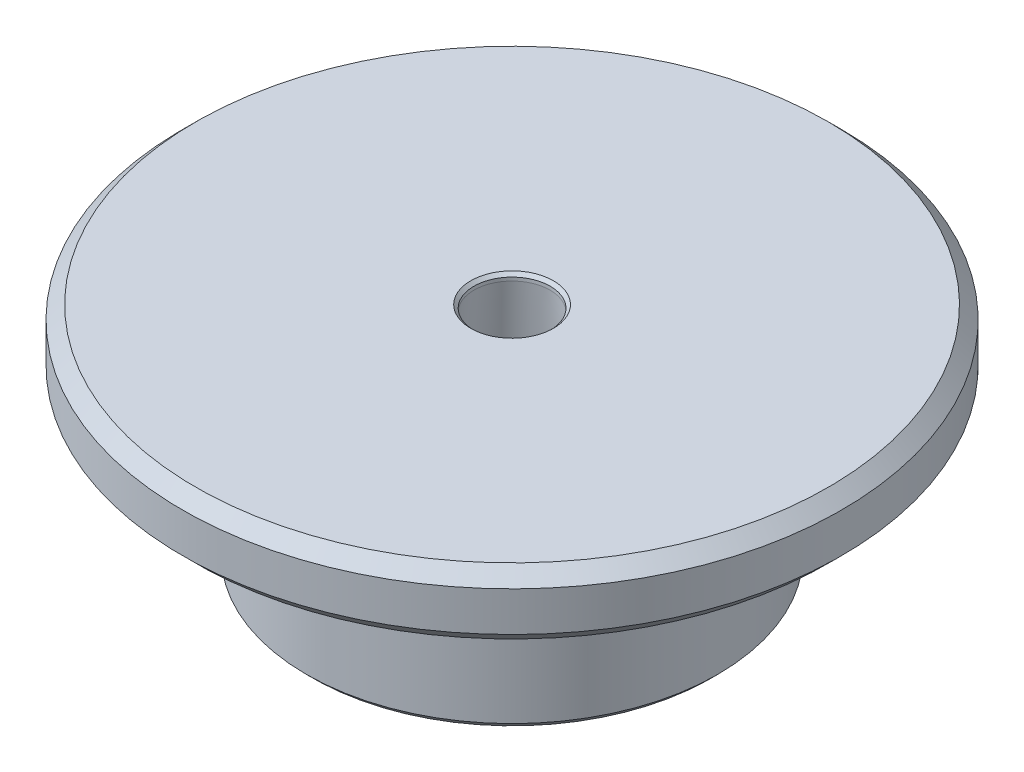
ISO-10303-21;
HEADER;
FILE_DESCRIPTION(('STEP AP214'),'2;1');
FILE_NAME('part.step','',(''),(''),'','','');
FILE_SCHEMA(('AUTOMOTIVE_DESIGN { 1 0 10303 214 1 1 1 1 }'));
ENDSEC;
DATA;
#1=APPLICATION_CONTEXT('core data for automotive mechanical design processes');
#2=APPLICATION_PROTOCOL_DEFINITION('international standard','automotive_design',2000,#1);
#3=PRODUCT_CONTEXT('',#1,'mechanical');
#4=PRODUCT('Part','Part','',(#3));
#5=PRODUCT_RELATED_PRODUCT_CATEGORY('part','',(#4));
#6=PRODUCT_DEFINITION_FORMATION('','',#4);
#7=PRODUCT_DEFINITION_CONTEXT('part definition',#1,'design');
#8=PRODUCT_DEFINITION('design','',#6,#7);
#9=PRODUCT_DEFINITION_SHAPE('','',#8);
#10=(LENGTH_UNIT() NAMED_UNIT(*) SI_UNIT(.MILLI.,.METRE.));
#11=(NAMED_UNIT(*) PLANE_ANGLE_UNIT() SI_UNIT($,.RADIAN.));
#12=(NAMED_UNIT(*) SI_UNIT($,.STERADIAN.) SOLID_ANGLE_UNIT());
#13=UNCERTAINTY_MEASURE_WITH_UNIT(LENGTH_MEASURE(1.E-05),#10,'distance_accuracy_value','');
#14=(GEOMETRIC_REPRESENTATION_CONTEXT(3) GLOBAL_UNCERTAINTY_ASSIGNED_CONTEXT((#13)) GLOBAL_UNIT_ASSIGNED_CONTEXT((#10,
#11,#12)) REPRESENTATION_CONTEXT('',''));
#15=CARTESIAN_POINT('',(0.,0.,0.));
#16=DIRECTION('',(0.,0.,1.));
#17=DIRECTION('',(1.,0.,0.));
#18=AXIS2_PLACEMENT_3D('',#15,#16,#17);
#19=CARTESIAN_POINT('',(0.,-14.4,0.));
#20=DIRECTION('',(0.,-1.,0.));
#21=DIRECTION('',(0.,0.,-1.));
#22=AXIS2_PLACEMENT_3D('',#19,#20,#21);
#23=TOROIDAL_SURFACE('',#22,12.5,0.399999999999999);
#24=CARTESIAN_POINT('',(0.,-14.0107965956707,0.));
#25=DIRECTION('',(0.,-1.,0.));
#26=DIRECTION('',(0.,0.,-1.));
#27=AXIS2_PLACEMENT_3D('',#24,#25,#26);
#28=CIRCLE('',#27,12.4076923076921);
#29=CARTESIAN_POINT('',(0.,-14.0107965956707,-12.4076923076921));
#30=VERTEX_POINT('',#29);
#31=EDGE_CURVE('E10',#30,#30,#28,.F.);
#32=ORIENTED_EDGE('',*,*,#31,.T.);
#33=EDGE_LOOP('',(#32));
#34=FACE_BOUND('',#33,.T.);
#35=CARTESIAN_POINT('',(0.,-14.5780184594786,0.));
#36=DIRECTION('',(0.,-1.,0.));
#37=DIRECTION('',(0.,0.,-1.));
#38=AXIS2_PLACEMENT_3D('',#35,#36,#37);
#39=CIRCLE('',#38,12.1417969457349);
#40=CARTESIAN_POINT('',(0.,-14.5780184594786,-12.1417969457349));
#41=VERTEX_POINT('',#40);
#42=EDGE_CURVE('E120',#41,#41,#39,.T.);
#43=ORIENTED_EDGE('',*,*,#42,.T.);
#44=EDGE_LOOP('',(#43));
#45=FACE_BOUND('',#44,.T.);
#46=ADVANCED_FACE('F34',(#34,#45),#23,.T.);
#47=CARTESIAN_POINT('',(0.,-15.5,0.));
#48=DIRECTION('',(0.,-1.,0.));
#49=DIRECTION('',(0.,0.,-1.));
#50=AXIS2_PLACEMENT_3D('',#47,#48,#49);
#51=CONICAL_SURFACE('',#50,12.6,0.461225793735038);
#52=ORIENTED_EDGE('',*,*,#42,.F.);
#53=EDGE_LOOP('',(#52));
#54=FACE_BOUND('',#53,.T.);
#55=CARTESIAN_POINT('',(0.,-15.5,0.));
#56=DIRECTION('',(0.,-1.,0.));
#57=DIRECTION('',(0.,0.,-1.));
#58=AXIS2_PLACEMENT_3D('',#55,#56,#57);
#59=CIRCLE('',#58,12.6);
#60=CARTESIAN_POINT('',(0.,-15.5,-12.6));
#61=VERTEX_POINT('',#60);
#62=EDGE_CURVE('E124',#61,#61,#59,.T.);
#63=ORIENTED_EDGE('',*,*,#62,.T.);
#64=EDGE_LOOP('',(#63));
#65=FACE_BOUND('',#64,.T.);
#66=ADVANCED_FACE('F130',(#54,#65),#51,.F.);
#67=CARTESIAN_POINT('',(0.,0.,0.));
#68=DIRECTION('',(0.,-1.,0.));
#69=DIRECTION('',(0.,0.,-1.));
#70=AXIS2_PLACEMENT_3D('',#67,#68,#69);
#71=CYLINDRICAL_SURFACE('',#70,2.89378967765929);
#72=CARTESIAN_POINT('',(0.,-0.240000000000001,0.));
#73=DIRECTION('',(0.,-1.,0.));
#74=DIRECTION('',(0.,0.,-1.));
#75=AXIS2_PLACEMENT_3D('',#72,#73,#74);
#76=CIRCLE('',#75,2.89378967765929);
#77=CARTESIAN_POINT('',(0.,-0.240000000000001,-2.89378967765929));
#78=VERTEX_POINT('',#77);
#79=EDGE_CURVE('E102',#78,#78,#76,.F.);
#80=ORIENTED_EDGE('',*,*,#79,.T.);
#81=EDGE_LOOP('',(#80));
#82=FACE_BOUND('',#81,.T.);
#83=CARTESIAN_POINT('',(0.,-0.5,0.));
#84=DIRECTION('',(0.,-1.,0.));
#85=DIRECTION('',(0.,0.,-1.));
#86=AXIS2_PLACEMENT_3D('',#83,#84,#85);
#87=CIRCLE('',#86,2.89378967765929);
#88=CARTESIAN_POINT('',(0.,-0.5,-2.89378967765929));
#89=VERTEX_POINT('',#88);
#90=EDGE_CURVE('E121',#89,#89,#87,.T.);
#91=ORIENTED_EDGE('',*,*,#90,.T.);
#92=EDGE_LOOP('',(#91));
#93=FACE_BOUND('',#92,.T.);
#94=ADVANCED_FACE('F146',(#82,#93),#71,.F.);
#95=CARTESIAN_POINT('',(2.89378967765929,0.,0.));
#96=DIRECTION('',(0.,-1.,0.));
#97=DIRECTION('',(0.,0.,-1.));
#98=AXIS2_PLACEMENT_3D('',#95,#96,#97);
#99=PLANE('',#98);
#100=CARTESIAN_POINT('',(0.,0.,0.));
#101=DIRECTION('',(0.,-1.,0.));
#102=DIRECTION('',(0.,0.,-1.));
#103=AXIS2_PLACEMENT_3D('',#100,#101,#102);
#104=CIRCLE('',#103,3.13378967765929);
#105=CARTESIAN_POINT('',(0.,0.,-3.13378967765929));
#106=VERTEX_POINT('',#105);
#107=EDGE_CURVE('E105',#106,#106,#104,.T.);
#108=ORIENTED_EDGE('',*,*,#107,.T.);
#109=EDGE_LOOP('',(#108));
#110=FACE_BOUND('',#109,.T.);
#111=CARTESIAN_POINT('',(0.,0.,0.));
#112=DIRECTION('',(0.,-1.,0.));
#113=DIRECTION('',(0.,0.,-1.));
#114=AXIS2_PLACEMENT_3D('',#111,#112,#113);
#115=CIRCLE('',#114,24.);
#116=CARTESIAN_POINT('',(0.,0.,-24.));
#117=VERTEX_POINT('',#116);
#118=EDGE_CURVE('E108',#117,#117,#115,.F.);
#119=ORIENTED_EDGE('',*,*,#118,.T.);
#120=EDGE_LOOP('',(#119));
#121=FACE_BOUND('',#120,.T.);
#122=ADVANCED_FACE('F246',(#110,#121),#99,.F.);
#123=CARTESIAN_POINT('',(0.,0.,0.));
#124=DIRECTION('',(0.,-1.,0.));
#125=DIRECTION('',(0.,0.,-1.));
#126=AXIS2_PLACEMENT_3D('',#123,#124,#125);
#127=CYLINDRICAL_SURFACE('',#126,25.);
#128=CARTESIAN_POINT('',(0.,-4.00000000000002,0.));
#129=DIRECTION('',(0.,-1.,0.));
#130=DIRECTION('',(0.,0.,-1.));
#131=AXIS2_PLACEMENT_3D('',#128,#129,#130);
#132=CIRCLE('',#131,25.);
#133=CARTESIAN_POINT('',(0.,-4.00000000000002,-25.));
#134=VERTEX_POINT('',#133);
#135=EDGE_CURVE('E111',#134,#134,#132,.F.);
#136=ORIENTED_EDGE('',*,*,#135,.T.);
#137=EDGE_LOOP('',(#136));
#138=FACE_BOUND('',#137,.T.);
#139=CARTESIAN_POINT('',(0.,-0.999999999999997,0.));
#140=DIRECTION('',(0.,-1.,0.));
#141=DIRECTION('',(0.,0.,-1.));
#142=AXIS2_PLACEMENT_3D('',#139,#140,#141);
#143=CIRCLE('',#142,25.);
#144=CARTESIAN_POINT('',(0.,-0.999999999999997,-25.));
#145=VERTEX_POINT('',#144);
#146=EDGE_CURVE('E114',#145,#145,#143,.T.);
#147=ORIENTED_EDGE('',*,*,#146,.T.);
#148=EDGE_LOOP('',(#147));
#149=FACE_BOUND('',#148,.T.);
#150=ADVANCED_FACE('F250',(#138,#149),#127,.T.);
#151=CARTESIAN_POINT('',(15.6,-5.,0.));
#152=DIRECTION('',(0.,-1.,0.));
#153=DIRECTION('',(0.,0.,-1.));
#154=AXIS2_PLACEMENT_3D('',#151,#152,#153);
#155=PLANE('',#154);
#156=CARTESIAN_POINT('',(0.,-5.,0.));
#157=DIRECTION('',(0.,-1.,0.));
#158=DIRECTION('',(0.,0.,-1.));
#159=AXIS2_PLACEMENT_3D('',#156,#157,#158);
#160=CIRCLE('',#159,20.6);
#161=CARTESIAN_POINT('',(0.,-5.,-20.6));
#162=VERTEX_POINT('',#161);
#163=EDGE_CURVE('E66',#162,#162,#160,.F.);
#164=ORIENTED_EDGE('',*,*,#163,.T.);
#165=EDGE_LOOP('',(#164));
#166=FACE_BOUND('',#165,.T.);
#167=CARTESIAN_POINT('',(0.,-5.,0.));
#168=DIRECTION('',(0.,-1.,0.));
#169=DIRECTION('',(0.,0.,-1.));
#170=AXIS2_PLACEMENT_3D('',#167,#168,#169);
#171=CIRCLE('',#170,24.);
#172=CARTESIAN_POINT('',(0.,-5.,-24.));
#173=VERTEX_POINT('',#172);
#174=EDGE_CURVE('E117',#173,#173,#171,.T.);
#175=ORIENTED_EDGE('',*,*,#174,.T.);
#176=EDGE_LOOP('',(#175));
#177=FACE_BOUND('',#176,.T.);
#178=ADVANCED_FACE('F254',(#166,#177),#155,.T.);
#179=CARTESIAN_POINT('',(0.,0.,0.));
#180=DIRECTION('',(0.,-1.,0.));
#181=DIRECTION('',(0.,0.,-1.));
#182=AXIS2_PLACEMENT_3D('',#179,#180,#181);
#183=CYLINDRICAL_SURFACE('',#182,15.6);
#184=CARTESIAN_POINT('',(0.,-10.,0.));
#185=DIRECTION('',(0.,-1.,0.));
#186=DIRECTION('',(0.,0.,-1.));
#187=AXIS2_PLACEMENT_3D('',#184,#185,#186);
#188=CIRCLE('',#187,15.6);
#189=CARTESIAN_POINT('',(0.,-10.,-15.6));
#190=VERTEX_POINT('',#189);
#191=EDGE_CURVE('E69',#190,#190,#188,.T.);
#192=ORIENTED_EDGE('',*,*,#191,.T.);
#193=EDGE_LOOP('',(#192));
#194=FACE_BOUND('',#193,.T.);
#195=CARTESIAN_POINT('',(0.,-16.5,0.));
#196=DIRECTION('',(0.,-1.,0.));
#197=DIRECTION('',(0.,0.,-1.));
#198=AXIS2_PLACEMENT_3D('',#195,#196,#197);
#199=CIRCLE('',#198,15.6);
#200=CARTESIAN_POINT('',(0.,-16.5,-15.6));
#201=VERTEX_POINT('',#200);
#202=EDGE_CURVE('E81',#201,#201,#199,.F.);
#203=ORIENTED_EDGE('',*,*,#202,.T.);
#204=EDGE_LOOP('',(#203));
#205=FACE_BOUND('',#204,.T.);
#206=ADVANCED_FACE('F147',(#194,#205),#183,.T.);
#207=CARTESIAN_POINT('',(12.6,-17.,0.));
#208=DIRECTION('',(0.,-1.,0.));
#209=DIRECTION('',(0.,0.,-1.));
#210=AXIS2_PLACEMENT_3D('',#207,#208,#209);
#211=PLANE('',#210);
#212=CARTESIAN_POINT('',(0.,-17.,0.));
#213=DIRECTION('',(0.,-1.,0.));
#214=DIRECTION('',(0.,0.,-1.));
#215=AXIS2_PLACEMENT_3D('',#212,#213,#214);
#216=CIRCLE('',#215,15.1);
#217=CARTESIAN_POINT('',(0.,-17.,-15.1));
#218=VERTEX_POINT('',#217);
#219=EDGE_CURVE('E84',#218,#218,#216,.T.);
#220=ORIENTED_EDGE('',*,*,#219,.T.);
#221=EDGE_LOOP('',(#220));
#222=FACE_BOUND('',#221,.T.);
#223=CARTESIAN_POINT('',(0.,-17.,0.));
#224=DIRECTION('',(0.,-1.,0.));
#225=DIRECTION('',(0.,0.,-1.));
#226=AXIS2_PLACEMENT_3D('',#223,#224,#225);
#227=CIRCLE('',#226,13.1);
#228=CARTESIAN_POINT('',(0.,-17.,-13.1));
#229=VERTEX_POINT('',#228);
#230=EDGE_CURVE('E87',#229,#229,#227,.F.);
#231=ORIENTED_EDGE('',*,*,#230,.T.);
#232=EDGE_LOOP('',(#231));
#233=FACE_BOUND('',#232,.T.);
#234=ADVANCED_FACE('F135',(#222,#233),#211,.T.);
#235=CARTESIAN_POINT('',(0.,0.,0.));
#236=DIRECTION('',(0.,-1.,0.));
#237=DIRECTION('',(0.,0.,-1.));
#238=AXIS2_PLACEMENT_3D('',#235,#236,#237);
#239=CYLINDRICAL_SURFACE('',#238,12.6);
#240=CARTESIAN_POINT('',(0.,-16.5,0.));
#241=DIRECTION('',(0.,-1.,0.));
#242=DIRECTION('',(0.,0.,-1.));
#243=AXIS2_PLACEMENT_3D('',#240,#241,#242);
#244=CIRCLE('',#243,12.6);
#245=CARTESIAN_POINT('',(0.,-16.5,-12.6));
#246=VERTEX_POINT('',#245);
#247=EDGE_CURVE('E78',#246,#246,#244,.T.);
#248=ORIENTED_EDGE('',*,*,#247,.T.);
#249=EDGE_LOOP('',(#248));
#250=FACE_BOUND('',#249,.T.);
#251=ORIENTED_EDGE('',*,*,#62,.F.);
#252=EDGE_LOOP('',(#251));
#253=FACE_BOUND('',#252,.T.);
#254=ADVANCED_FACE('F132',(#250,#253),#239,.F.);
#255=CARTESIAN_POINT('',(0.,-0.5,0.));
#256=DIRECTION('',(0.,-1.,0.));
#257=DIRECTION('',(0.,0.,-1.));
#258=AXIS2_PLACEMENT_3D('',#255,#256,#257);
#259=CONICAL_SURFACE('',#258,2.89378967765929,0.0872664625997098);
#260=CARTESIAN_POINT('',(0.,-5.27178893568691,0.));
#261=DIRECTION('',(0.,1.,0.));
#262=DIRECTION('',(0.,0.,1.));
#263=AXIS2_PLACEMENT_3D('',#260,#261,#262);
#264=CIRCLE('',#263,3.3112671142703);
#265=CARTESIAN_POINT('',(0.,-5.27178893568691,3.3112671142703));
#266=VERTEX_POINT('',#265);
#267=EDGE_CURVE('E57',#266,#266,#264,.F.);
#268=ORIENTED_EDGE('',*,*,#267,.T.);
#269=EDGE_LOOP('',(#268));
#270=FACE_BOUND('',#269,.T.);
#271=ORIENTED_EDGE('',*,*,#90,.F.);
#272=EDGE_LOOP('',(#271));
#273=FACE_BOUND('',#272,.T.);
#274=ADVANCED_FACE('F134',(#270,#273),#259,.F.);
#275=CARTESIAN_POINT('',(3.33123299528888,-5.5,0.));
#276=DIRECTION('',(0.,-1.,0.));
#277=DIRECTION('',(0.,0.,-1.));
#278=AXIS2_PLACEMENT_3D('',#275,#276,#277);
#279=PLANE('',#278);
#280=CARTESIAN_POINT('',(0.,-5.5,0.));
#281=DIRECTION('',(0.,-1.,0.));
#282=DIRECTION('',(0.,0.,-1.));
#283=AXIS2_PLACEMENT_3D('',#280,#281,#282);
#284=CIRCLE('',#283,3.56031578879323);
#285=CARTESIAN_POINT('',(0.,-5.5,-3.56031578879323));
#286=VERTEX_POINT('',#285);
#287=EDGE_CURVE('E54',#286,#286,#284,.F.);
#288=ORIENTED_EDGE('',*,*,#287,.T.);
#289=EDGE_LOOP('',(#288));
#290=FACE_BOUND('',#289,.T.);
#291=CARTESIAN_POINT('',(0.,-5.5,0.));
#292=DIRECTION('',(0.,-1.,0.));
#293=DIRECTION('',(0.,0.,-1.));
#294=AXIS2_PLACEMENT_3D('',#291,#292,#293);
#295=CIRCLE('',#294,6.94999999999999);
#296=CARTESIAN_POINT('',(0.,-5.5,-6.94999999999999));
#297=VERTEX_POINT('',#296);
#298=EDGE_CURVE('E99',#297,#297,#295,.T.);
#299=ORIENTED_EDGE('',*,*,#298,.T.);
#300=EDGE_LOOP('',(#299));
#301=FACE_BOUND('',#300,.T.);
#302=ADVANCED_FACE('F143',(#290,#301),#279,.T.);
#303=CARTESIAN_POINT('',(0.,0.,0.));
#304=DIRECTION('',(0.,-1.,0.));
#305=DIRECTION('',(0.,0.,-1.));
#306=AXIS2_PLACEMENT_3D('',#303,#304,#305);
#307=CYLINDRICAL_SURFACE('',#306,7.95);
#308=CARTESIAN_POINT('',(0.,-14.75,0.));
#309=DIRECTION('',(0.,-1.,0.));
#310=DIRECTION('',(0.,0.,-1.));
#311=AXIS2_PLACEMENT_3D('',#308,#309,#310);
#312=CIRCLE('',#311,7.95);
#313=CARTESIAN_POINT('',(0.,-14.75,-7.95));
#314=VERTEX_POINT('',#313);
#315=EDGE_CURVE('E49',#314,#314,#312,.T.);
#316=ORIENTED_EDGE('',*,*,#315,.T.);
#317=EDGE_LOOP('',(#316));
#318=FACE_BOUND('',#317,.T.);
#319=CARTESIAN_POINT('',(0.,-6.5,0.));
#320=DIRECTION('',(0.,-1.,0.));
#321=DIRECTION('',(0.,0.,-1.));
#322=AXIS2_PLACEMENT_3D('',#319,#320,#321);
#323=CIRCLE('',#322,7.95);
#324=CARTESIAN_POINT('',(0.,-6.5,-7.95));
#325=VERTEX_POINT('',#324);
#326=EDGE_CURVE('E96',#325,#325,#323,.F.);
#327=ORIENTED_EDGE('',*,*,#326,.T.);
#328=EDGE_LOOP('',(#327));
#329=FACE_BOUND('',#328,.T.);
#330=ADVANCED_FACE('F228',(#318,#329),#307,.F.);
#331=CARTESIAN_POINT('',(7.95,-15.,0.));
#332=DIRECTION('',(0.,-1.,0.));
#333=DIRECTION('',(0.,0.,-1.));
#334=AXIS2_PLACEMENT_3D('',#331,#332,#333);
#335=PLANE('',#334);
#336=CARTESIAN_POINT('',(0.,-15.,0.));
#337=DIRECTION('',(0.,-1.,0.));
#338=DIRECTION('',(0.,0.,-1.));
#339=AXIS2_PLACEMENT_3D('',#336,#337,#338);
#340=CIRCLE('',#339,8.2);
#341=CARTESIAN_POINT('',(0.,-15.,-8.2));
#342=VERTEX_POINT('',#341);
#343=EDGE_CURVE('E45',#342,#342,#340,.F.);
#344=ORIENTED_EDGE('',*,*,#343,.T.);
#345=EDGE_LOOP('',(#344));
#346=FACE_BOUND('',#345,.T.);
#347=CARTESIAN_POINT('',(0.,-15.,0.));
#348=DIRECTION('',(0.,-1.,0.));
#349=DIRECTION('',(0.,0.,-1.));
#350=AXIS2_PLACEMENT_3D('',#347,#348,#349);
#351=CIRCLE('',#350,9.45000000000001);
#352=CARTESIAN_POINT('',(0.,-15.,-9.45000000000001));
#353=VERTEX_POINT('',#352);
#354=EDGE_CURVE('E75',#353,#353,#351,.T.);
#355=ORIENTED_EDGE('',*,*,#354,.T.);
#356=EDGE_LOOP('',(#355));
#357=FACE_BOUND('',#356,.T.);
#358=ADVANCED_FACE('F231',(#346,#357),#335,.T.);
#359=CARTESIAN_POINT('',(0.,0.,0.));
#360=DIRECTION('',(0.,-1.,0.));
#361=DIRECTION('',(0.,0.,-1.));
#362=AXIS2_PLACEMENT_3D('',#359,#360,#361);
#363=CYLINDRICAL_SURFACE('',#362,9.95);
#364=CARTESIAN_POINT('',(0.,-1.25,0.));
#365=DIRECTION('',(0.,-1.,0.));
#366=DIRECTION('',(0.,0.,-1.));
#367=AXIS2_PLACEMENT_3D('',#364,#365,#366);
#368=CIRCLE('',#367,9.95);
#369=CARTESIAN_POINT('',(0.,-1.25,-9.95));
#370=VERTEX_POINT('',#369);
#371=EDGE_CURVE('E63',#370,#370,#368,.T.);
#372=ORIENTED_EDGE('',*,*,#371,.T.);
#373=EDGE_LOOP('',(#372));
#374=FACE_BOUND('',#373,.T.);
#375=CARTESIAN_POINT('',(0.,-14.5,0.));
#376=DIRECTION('',(0.,-1.,0.));
#377=DIRECTION('',(0.,0.,-1.));
#378=AXIS2_PLACEMENT_3D('',#375,#376,#377);
#379=CIRCLE('',#378,9.95);
#380=CARTESIAN_POINT('',(0.,-14.5,-9.95));
#381=VERTEX_POINT('',#380);
#382=EDGE_CURVE('E72',#381,#381,#379,.F.);
#383=ORIENTED_EDGE('',*,*,#382,.T.);
#384=EDGE_LOOP('',(#383));
#385=FACE_BOUND('',#384,.T.);
#386=ADVANCED_FACE('F160',(#374,#385),#363,.T.);
#387=CARTESIAN_POINT('',(9.95,-0.999999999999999,0.));
#388=DIRECTION('',(0.,-1.,0.));
#389=DIRECTION('',(0.,0.,-1.));
#390=AXIS2_PLACEMENT_3D('',#387,#388,#389);
#391=PLANE('',#390);
#392=CARTESIAN_POINT('',(0.,-0.999999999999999,0.));
#393=DIRECTION('',(0.,-1.,0.));
#394=DIRECTION('',(0.,0.,-1.));
#395=AXIS2_PLACEMENT_3D('',#392,#393,#394);
#396=CIRCLE('',#395,10.2);
#397=CARTESIAN_POINT('',(0.,-0.999999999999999,-10.2));
#398=VERTEX_POINT('',#397);
#399=EDGE_CURVE('E60',#398,#398,#396,.F.);
#400=ORIENTED_EDGE('',*,*,#399,.T.);
#401=EDGE_LOOP('',(#400));
#402=FACE_BOUND('',#401,.T.);
#403=CARTESIAN_POINT('',(0.,-0.999999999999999,0.));
#404=DIRECTION('',(0.,-1.,0.));
#405=DIRECTION('',(0.,0.,-1.));
#406=AXIS2_PLACEMENT_3D('',#403,#404,#405);
#407=CIRCLE('',#406,11.6);
#408=CARTESIAN_POINT('',(0.,-0.999999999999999,-11.6));
#409=VERTEX_POINT('',#408);
#410=EDGE_CURVE('E93',#409,#409,#407,.T.);
#411=ORIENTED_EDGE('',*,*,#410,.T.);
#412=EDGE_LOOP('',(#411));
#413=FACE_BOUND('',#412,.T.);
#414=ADVANCED_FACE('F153',(#402,#413),#391,.T.);
#415=CARTESIAN_POINT('',(0.,-13.7675444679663,0.));
#416=DIRECTION('',(0.,-1.,0.));
#417=DIRECTION('',(0.,0.,-1.));
#418=AXIS2_PLACEMENT_3D('',#415,#416,#417);
#419=CIRCLE('',#418,12.6);
#420=CARTESIAN_POINT('',(0.,-13.7675444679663,-12.6));
#421=VERTEX_POINT('',#420);
#422=EDGE_CURVE('E41',#421,#421,#419,.T.);
#423=ORIENTED_EDGE('',*,*,#422,.T.);
#424=EDGE_LOOP('',(#423));
#425=FACE_BOUND('',#424,.T.);
#426=CARTESIAN_POINT('',(0.,-1.99999999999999,0.));
#427=DIRECTION('',(0.,-1.,0.));
#428=DIRECTION('',(0.,0.,-1.));
#429=AXIS2_PLACEMENT_3D('',#426,#427,#428);
#430=CIRCLE('',#429,12.6);
#431=CARTESIAN_POINT('',(0.,-1.99999999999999,-12.6));
#432=VERTEX_POINT('',#431);
#433=EDGE_CURVE('E90',#432,#432,#430,.F.);
#434=ORIENTED_EDGE('',*,*,#433,.T.);
#435=EDGE_LOOP('',(#434));
#436=FACE_BOUND('',#435,.T.);
#437=ADVANCED_FACE('F138',(#425,#436),#239,.F.);
#438=CARTESIAN_POINT('',(0.,-5.,0.));
#439=DIRECTION('',(0.,1.,0.));
#440=DIRECTION('',(0.,0.,1.));
#441=AXIS2_PLACEMENT_3D('',#438,#439,#440);
#442=CONICAL_SURFACE('',#441,24.,0.785398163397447);
#443=ORIENTED_EDGE('',*,*,#135,.F.);
#444=EDGE_LOOP('',(#443));
#445=FACE_BOUND('',#444,.T.);
#446=ORIENTED_EDGE('',*,*,#174,.F.);
#447=EDGE_LOOP('',(#446));
#448=FACE_BOUND('',#447,.T.);
#449=ADVANCED_FACE('F152',(#445,#448),#442,.T.);
#450=CARTESIAN_POINT('',(0.,-0.999999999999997,0.));
#451=DIRECTION('',(0.,-1.,0.));
#452=DIRECTION('',(0.,0.,-1.));
#453=AXIS2_PLACEMENT_3D('',#450,#451,#452);
#454=CONICAL_SURFACE('',#453,25.,0.785398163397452);
#455=ORIENTED_EDGE('',*,*,#118,.F.);
#456=EDGE_LOOP('',(#455));
#457=FACE_BOUND('',#456,.T.);
#458=ORIENTED_EDGE('',*,*,#146,.F.);
#459=EDGE_LOOP('',(#458));
#460=FACE_BOUND('',#459,.T.);
#461=ADVANCED_FACE('F158',(#457,#460),#454,.T.);
#462=CARTESIAN_POINT('',(0.,0.,0.));
#463=DIRECTION('',(0.,1.,0.));
#464=DIRECTION('',(0.,0.,1.));
#465=AXIS2_PLACEMENT_3D('',#462,#463,#464);
#466=CONICAL_SURFACE('',#465,3.13378967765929,0.785398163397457);
#467=ORIENTED_EDGE('',*,*,#79,.F.);
#468=EDGE_LOOP('',(#467));
#469=FACE_BOUND('',#468,.T.);
#470=ORIENTED_EDGE('',*,*,#107,.F.);
#471=EDGE_LOOP('',(#470));
#472=FACE_BOUND('',#471,.T.);
#473=ADVANCED_FACE('F181',(#469,#472),#466,.F.);
#474=CARTESIAN_POINT('',(0.,-5.5,0.));
#475=DIRECTION('',(0.,-1.,0.));
#476=DIRECTION('',(0.,0.,-1.));
#477=AXIS2_PLACEMENT_3D('',#474,#475,#476);
#478=CONICAL_SURFACE('',#477,6.94999999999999,0.785398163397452);
#479=ORIENTED_EDGE('',*,*,#326,.F.);
#480=EDGE_LOOP('',(#479));
#481=FACE_BOUND('',#480,.T.);
#482=ORIENTED_EDGE('',*,*,#298,.F.);
#483=EDGE_LOOP('',(#482));
#484=FACE_BOUND('',#483,.T.);
#485=ADVANCED_FACE('F170',(#481,#484),#478,.F.);
#486=CARTESIAN_POINT('',(0.,-0.999999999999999,0.));
#487=DIRECTION('',(0.,-1.,0.));
#488=DIRECTION('',(0.,0.,-1.));
#489=AXIS2_PLACEMENT_3D('',#486,#487,#488);
#490=CONICAL_SURFACE('',#489,11.6,0.785398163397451);
#491=ORIENTED_EDGE('',*,*,#433,.F.);
#492=EDGE_LOOP('',(#491));
#493=FACE_BOUND('',#492,.T.);
#494=ORIENTED_EDGE('',*,*,#410,.F.);
#495=EDGE_LOOP('',(#494));
#496=FACE_BOUND('',#495,.T.);
#497=ADVANCED_FACE('F166',(#493,#496),#490,.F.);
#498=CARTESIAN_POINT('',(0.,-17.,0.));
#499=DIRECTION('',(0.,1.,0.));
#500=DIRECTION('',(0.,0.,1.));
#501=AXIS2_PLACEMENT_3D('',#498,#499,#500);
#502=CONICAL_SURFACE('',#501,15.1,0.785398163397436);
#503=ORIENTED_EDGE('',*,*,#202,.F.);
#504=EDGE_LOOP('',(#503));
#505=FACE_BOUND('',#504,.T.);
#506=ORIENTED_EDGE('',*,*,#219,.F.);
#507=EDGE_LOOP('',(#506));
#508=FACE_BOUND('',#507,.T.);
#509=ADVANCED_FACE('F169',(#505,#508),#502,.T.);
#510=CARTESIAN_POINT('',(0.,-16.5,0.));
#511=DIRECTION('',(0.,-1.,0.));
#512=DIRECTION('',(0.,0.,-1.));
#513=AXIS2_PLACEMENT_3D('',#510,#511,#512);
#514=CONICAL_SURFACE('',#513,12.6,0.785398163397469);
#515=ORIENTED_EDGE('',*,*,#230,.F.);
#516=EDGE_LOOP('',(#515));
#517=FACE_BOUND('',#516,.T.);
#518=ORIENTED_EDGE('',*,*,#247,.F.);
#519=EDGE_LOOP('',(#518));
#520=FACE_BOUND('',#519,.T.);
#521=ADVANCED_FACE('F178',(#517,#520),#514,.F.);
#522=CARTESIAN_POINT('',(0.,-15.,0.));
#523=DIRECTION('',(0.,1.,0.));
#524=DIRECTION('',(0.,0.,1.));
#525=AXIS2_PLACEMENT_3D('',#522,#523,#524);
#526=CONICAL_SURFACE('',#525,9.45000000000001,0.785398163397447);
#527=ORIENTED_EDGE('',*,*,#382,.F.);
#528=EDGE_LOOP('',(#527));
#529=FACE_BOUND('',#528,.T.);
#530=ORIENTED_EDGE('',*,*,#354,.F.);
#531=EDGE_LOOP('',(#530));
#532=FACE_BOUND('',#531,.T.);
#533=ADVANCED_FACE('F199',(#529,#532),#526,.T.);
#534=CARTESIAN_POINT('',(0.,-10.,0.));
#535=DIRECTION('',(0.,-1.,0.));
#536=DIRECTION('',(0.,0.,-1.));
#537=AXIS2_PLACEMENT_3D('',#534,#535,#536);
#538=TOROIDAL_SURFACE('',#537,20.6,5.);
#539=ORIENTED_EDGE('',*,*,#163,.F.);
#540=EDGE_LOOP('',(#539));
#541=FACE_BOUND('',#540,.T.);
#542=ORIENTED_EDGE('',*,*,#191,.F.);
#543=EDGE_LOOP('',(#542));
#544=FACE_BOUND('',#543,.T.);
#545=ADVANCED_FACE('F205',(#541,#544),#538,.F.);
#546=CARTESIAN_POINT('',(0.,-1.25,0.));
#547=DIRECTION('',(0.,-1.,0.));
#548=DIRECTION('',(0.,0.,-1.));
#549=AXIS2_PLACEMENT_3D('',#546,#547,#548);
#550=TOROIDAL_SURFACE('',#549,10.2,0.25);
#551=ORIENTED_EDGE('',*,*,#399,.F.);
#552=EDGE_LOOP('',(#551));
#553=FACE_BOUND('',#552,.T.);
#554=ORIENTED_EDGE('',*,*,#371,.F.);
#555=EDGE_LOOP('',(#554));
#556=FACE_BOUND('',#555,.T.);
#557=ADVANCED_FACE('F209',(#553,#556),#550,.F.);
#558=CARTESIAN_POINT('',(0.,-5.25,0.));
#559=DIRECTION('',(0.,-1.,0.));
#560=DIRECTION('',(0.,0.,-1.));
#561=AXIS2_PLACEMENT_3D('',#558,#559,#560);
#562=TOROIDAL_SURFACE('',#561,3.56031578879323,0.25);
#563=ORIENTED_EDGE('',*,*,#287,.F.);
#564=EDGE_LOOP('',(#563));
#565=FACE_BOUND('',#564,.T.);
#566=ORIENTED_EDGE('',*,*,#267,.F.);
#567=EDGE_LOOP('',(#566));
#568=FACE_BOUND('',#567,.T.);
#569=ADVANCED_FACE('F213',(#565,#568),#562,.T.);
#570=CARTESIAN_POINT('',(0.,-14.75,0.));
#571=DIRECTION('',(0.,-1.,0.));
#572=DIRECTION('',(0.,0.,-1.));
#573=AXIS2_PLACEMENT_3D('',#570,#571,#572);
#574=TOROIDAL_SURFACE('',#573,8.2,0.25);
#575=ORIENTED_EDGE('',*,*,#343,.F.);
#576=EDGE_LOOP('',(#575));
#577=FACE_BOUND('',#576,.T.);
#578=ORIENTED_EDGE('',*,*,#315,.F.);
#579=EDGE_LOOP('',(#578));
#580=FACE_BOUND('',#579,.T.);
#581=ADVANCED_FACE('F216',(#577,#580),#574,.T.);
#582=CARTESIAN_POINT('',(0.,-13.7675444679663,0.));
#583=DIRECTION('',(0.,-1.,0.));
#584=DIRECTION('',(0.,0.,-1.));
#585=AXIS2_PLACEMENT_3D('',#582,#583,#584);
#586=TOROIDAL_SURFACE('',#585,12.35,0.25);
#587=ORIENTED_EDGE('',*,*,#31,.F.);
#588=EDGE_LOOP('',(#587));
#589=FACE_BOUND('',#588,.T.);
#590=ORIENTED_EDGE('',*,*,#422,.F.);
#591=EDGE_LOOP('',(#590));
#592=FACE_BOUND('',#591,.T.);
#593=ADVANCED_FACE('F36',(#589,#592),#586,.F.);
#594=CLOSED_SHELL('',(#46,#66,#94,#122,#150,#178,#206,#234,#254,#274,#302,#330,#358,#386,#414,
#437,#449,#461,#473,#485,#497,#509,#521,#533,#545,#557,#569,#581,#593));
#595=MANIFOLD_SOLID_BREP('B2',#594);
#596=ADVANCED_BREP_SHAPE_REPRESENTATION('',(#18,#595),#14);
#597=SHAPE_DEFINITION_REPRESENTATION(#9,#596);
ENDSEC;
END-ISO-10303-21;
